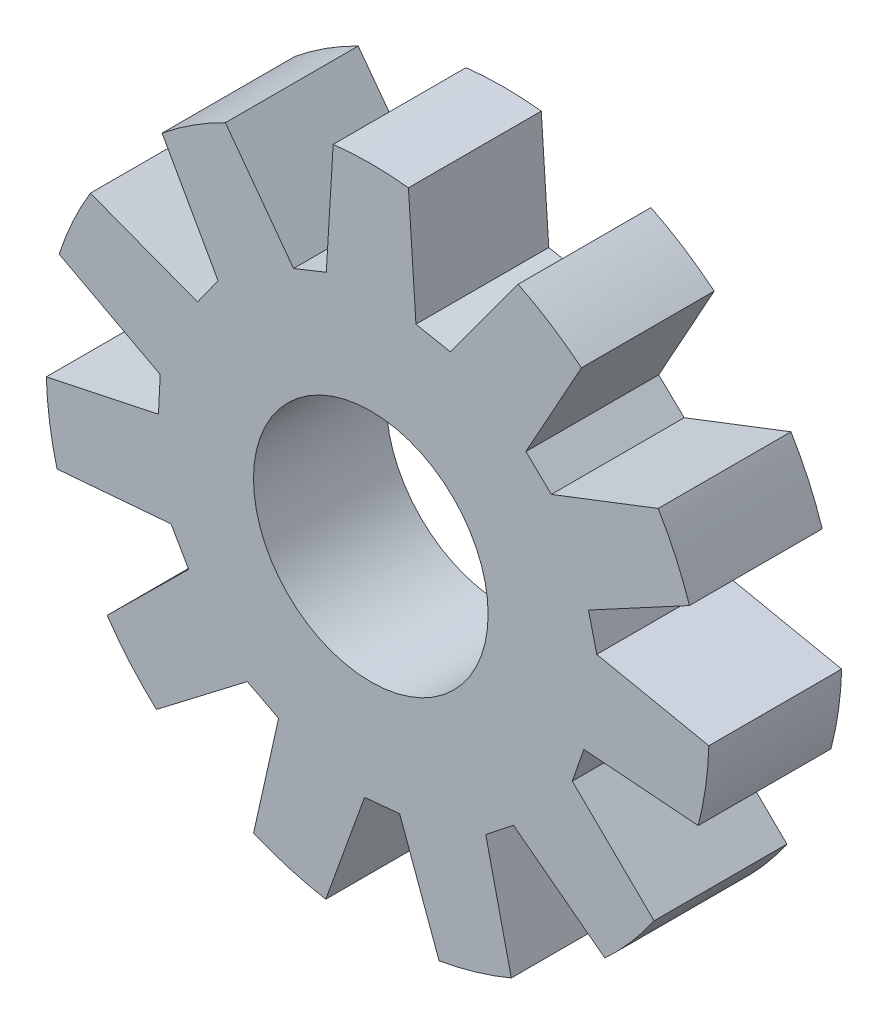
from build123d import *

# Parameters (mm, degrees)
SKETCH2_R           = 2.65
BOSS_EXTRUDE1_DEPTH = 3


with BuildPart() as part:
    # Sketch2 → Boss-Extrude1 (new body)
    with BuildSketch(Plane.XY):
        with BuildLine():
            Line((4.622774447, 5.86900064), (3.36860456, 3.604119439))
            Line((3.36860456, 3.604119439), (3.944186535, 3.054043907))
            Line((3.944186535, 3.054043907), (6.355741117, 3.984431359))
            ThreePointArc((6.355741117, 3.984431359), (6.752869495, 3.231349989), (7.061946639, 2.438056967))
            Line((7.061946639, 2.438056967), (4.782384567, 1.210773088))
            Line((4.782384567, 1.210773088), (4.969201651, 0.436836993))
            Line((4.969201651, 0.436836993), (7.500935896, -0.084256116))
            ThreePointArc((7.500935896, -0.084256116), (7.427875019, -0.93249229), (7.25900067, -1.766952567))
            Line((7.25900067, -1.766952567), (4.677791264, -1.566985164))
            Line((4.677791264, -1.566985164), (4.416530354, -2.319062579))
            Line((4.416530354, -2.319062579), (6.264636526, -4.126192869))
            ThreePointArc((6.264636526, -4.126192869), (5.744582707, -4.800274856), (5.151373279, -5.410967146))
            Line((5.151373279, -5.410967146), (3.088032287, -3.847236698))
            Line((3.088032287, -3.847236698), (2.461641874, -4.338676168))
            Line((2.461641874, -4.338676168), (3.039359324, -6.858092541))
            ThreePointArc((3.039359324, -6.858092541), (2.237425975, -7.144004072), (1.408221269, -7.337037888))
            Line((1.408221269, -7.337037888), (0.517844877, -4.906017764))
            Line((0.517844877, -4.906017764), (-0.274800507, -4.98079073))
            Line((-0.274800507, -4.98079073), (-1.150892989, -7.412596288))
            ThreePointArc((-1.150892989, -7.412596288), (-1.980097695, -7.219562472), (-2.782031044, -6.933650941))
            Line((-2.782031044, -6.933650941), (-2.216754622, -4.407172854))
            Line((-2.216754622, -4.407172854), (-2.923995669, -4.041539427))
            Line((-2.923995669, -4.041539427), (-4.97574491, -5.613653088))
            ThreePointArc((-4.97574491, -5.613653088), (-5.568954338, -5.002960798), (-6.089008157, -4.328878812))
            Line((-6.089008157, -4.328878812), (-4.247550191, -2.509081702))
            Line((-4.247550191, -2.509081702), (-4.644842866, -1.819127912))
            Line((-4.644842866, -1.819127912), (-7.220832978, -2.032414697))
            ThreePointArc((-7.220832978, -2.032414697), (-7.389707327, -1.19795442), (-7.462768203, -0.349718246))
            Line((-7.462768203, -0.349718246), (-4.929778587, 0.185625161))
            Line((-4.929778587, 0.185625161), (-4.890985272, 0.980843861))
            Line((-4.890985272, 0.980843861), (-7.173357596, 2.194101))
            ThreePointArc((-7.173357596, 2.194101), (-6.864280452, 2.987394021), (-6.467152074, 3.740475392))
            Line((-6.467152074, 3.740475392), (-4.046837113, 2.821397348))
            Line((-4.046837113, 2.821397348), (-3.584274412, 3.469404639))
            Line((-3.584274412, 3.469404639), (-4.848391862, 5.724005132))
            ThreePointArc((-4.848391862, 5.724005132), (-4.159493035, 6.224265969), (-3.418260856, 6.643094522))
            Line((-3.418260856, 6.643094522), (-1.87905345, 4.561395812))
            Line((-1.87905345, 4.561395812), (-1.139581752, 4.856453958))
            Line((-1.139581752, 4.856453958), (-0.984095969, 7.436578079))
            ThreePointArc((-0.984095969, 7.436578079), (-0.134095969, 7.484977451), (0.715904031, 7.436578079))
            Line((0.715904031, 7.436578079), (0.885316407, 4.853183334))
            Line((0.885316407, 4.853183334), (1.666920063, 4.701613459))
            Line((1.666920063, 4.701613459), (3.192643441, 6.78809003))
            ThreePointArc((3.192643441, 6.78809003), (3.93387562, 6.369261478), (4.622774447, 5.86900064))
        make_face()
        with Locations((-0.134095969, -0.003162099)):
            Circle(SKETCH2_R, mode=Mode.SUBTRACT)
    extrude(amount=BOSS_EXTRUDE1_DEPTH)


solid = part.part
